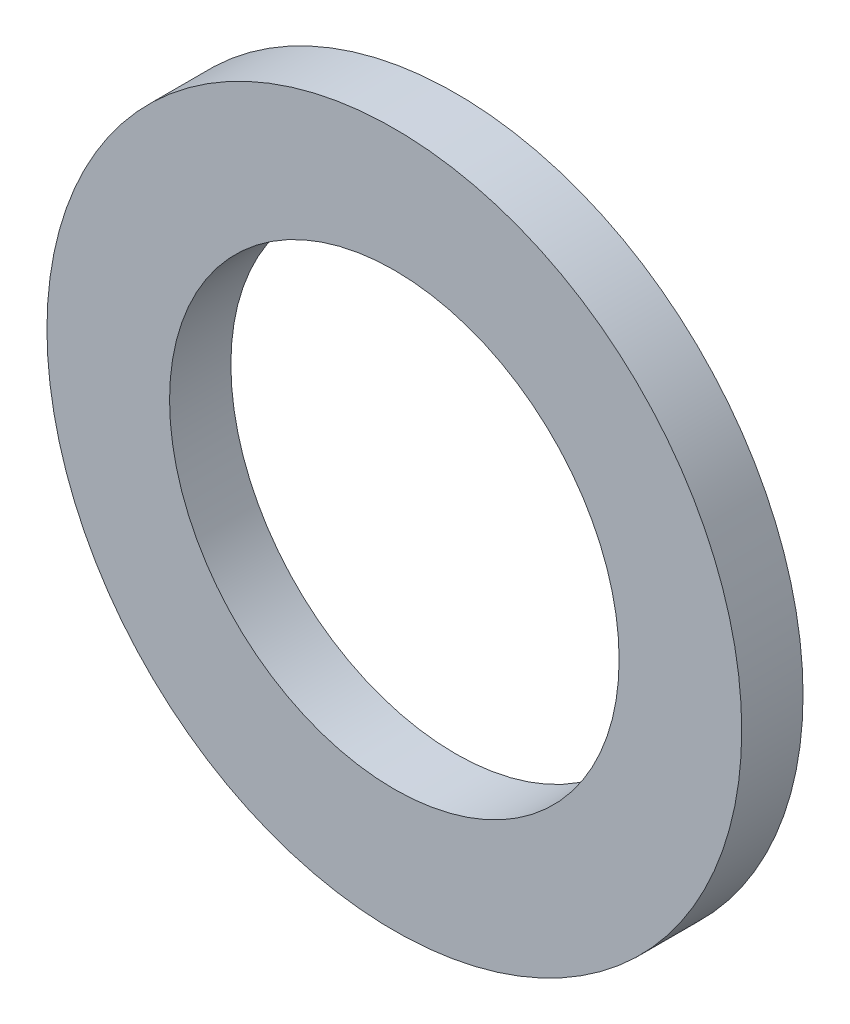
ISO-10303-21;
HEADER;
FILE_DESCRIPTION(('STEP AP214'),'2;1');
FILE_NAME('part.step','',(''),(''),'','','');
FILE_SCHEMA(('AUTOMOTIVE_DESIGN { 1 0 10303 214 1 1 1 1 }'));
ENDSEC;
DATA;
#1=APPLICATION_CONTEXT('core data for automotive mechanical design processes');
#2=APPLICATION_PROTOCOL_DEFINITION('international standard','automotive_design',2000,#1);
#3=PRODUCT_CONTEXT('',#1,'mechanical');
#4=PRODUCT('Part','Part','',(#3));
#5=PRODUCT_RELATED_PRODUCT_CATEGORY('part','',(#4));
#6=PRODUCT_DEFINITION_FORMATION('','',#4);
#7=PRODUCT_DEFINITION_CONTEXT('part definition',#1,'design');
#8=PRODUCT_DEFINITION('design','',#6,#7);
#9=PRODUCT_DEFINITION_SHAPE('','',#8);
#10=(LENGTH_UNIT() NAMED_UNIT(*) SI_UNIT(.MILLI.,.METRE.));
#11=(NAMED_UNIT(*) PLANE_ANGLE_UNIT() SI_UNIT($,.RADIAN.));
#12=(NAMED_UNIT(*) SI_UNIT($,.STERADIAN.) SOLID_ANGLE_UNIT());
#13=UNCERTAINTY_MEASURE_WITH_UNIT(LENGTH_MEASURE(1.E-05),#10,'distance_accuracy_value','');
#14=(GEOMETRIC_REPRESENTATION_CONTEXT(3) GLOBAL_UNCERTAINTY_ASSIGNED_CONTEXT((#13)) GLOBAL_UNIT_ASSIGNED_CONTEXT((#10,
#11,#12)) REPRESENTATION_CONTEXT('',''));
#15=CARTESIAN_POINT('',(0.,0.,0.));
#16=DIRECTION('',(0.,0.,1.));
#17=DIRECTION('',(1.,0.,0.));
#18=AXIS2_PLACEMENT_3D('',#15,#16,#17);
#19=CARTESIAN_POINT('',(0.,0.,3.));
#20=DIRECTION('',(0.,0.,1.));
#21=DIRECTION('',(1.,0.,0.));
#22=AXIS2_PLACEMENT_3D('',#19,#20,#21);
#23=PLANE('',#22);
#24=CARTESIAN_POINT('',(0.,0.,3.));
#25=DIRECTION('',(0.,0.,1.));
#26=DIRECTION('',(1.,0.,0.));
#27=AXIS2_PLACEMENT_3D('',#24,#25,#26);
#28=CIRCLE('',#27,17.);
#29=CARTESIAN_POINT('',(17.,0.,3.));
#30=VERTEX_POINT('',#29);
#31=EDGE_CURVE('E10',#30,#30,#28,.T.);
#32=ORIENTED_EDGE('',*,*,#31,.T.);
#33=EDGE_LOOP('',(#32));
#34=FACE_BOUND('',#33,.T.);
#35=CARTESIAN_POINT('',(0.,0.,3.));
#36=DIRECTION('',(0.,0.,1.));
#37=DIRECTION('',(1.,0.,0.));
#38=AXIS2_PLACEMENT_3D('',#35,#36,#37);
#39=CIRCLE('',#38,11.);
#40=CARTESIAN_POINT('',(11.,0.,3.));
#41=VERTEX_POINT('',#40);
#42=EDGE_CURVE('E39',#41,#41,#39,.T.);
#43=ORIENTED_EDGE('',*,*,#42,.F.);
#44=EDGE_LOOP('',(#43));
#45=FACE_BOUND('',#44,.T.);
#46=ADVANCED_FACE('F28',(#34,#45),#23,.T.);
#47=CARTESIAN_POINT('',(0.,0.,0.));
#48=DIRECTION('',(0.,0.,1.));
#49=DIRECTION('',(1.,0.,0.));
#50=AXIS2_PLACEMENT_3D('',#47,#48,#49);
#51=PLANE('',#50);
#52=CARTESIAN_POINT('',(0.,0.,0.));
#53=DIRECTION('',(0.,0.,1.));
#54=DIRECTION('',(1.,0.,0.));
#55=AXIS2_PLACEMENT_3D('',#52,#53,#54);
#56=CIRCLE('',#55,17.);
#57=CARTESIAN_POINT('',(17.,0.,0.));
#58=VERTEX_POINT('',#57);
#59=EDGE_CURVE('E35',#58,#58,#56,.T.);
#60=ORIENTED_EDGE('',*,*,#59,.F.);
#61=EDGE_LOOP('',(#60));
#62=FACE_BOUND('',#61,.T.);
#63=CARTESIAN_POINT('',(0.,0.,0.));
#64=DIRECTION('',(0.,0.,1.));
#65=DIRECTION('',(1.,0.,0.));
#66=AXIS2_PLACEMENT_3D('',#63,#64,#65);
#67=CIRCLE('',#66,11.);
#68=CARTESIAN_POINT('',(11.,0.,0.));
#69=VERTEX_POINT('',#68);
#70=EDGE_CURVE('E43',#69,#69,#67,.T.);
#71=ORIENTED_EDGE('',*,*,#70,.T.);
#72=EDGE_LOOP('',(#71));
#73=FACE_BOUND('',#72,.T.);
#74=ADVANCED_FACE('F49',(#62,#73),#51,.F.);
#75=CARTESIAN_POINT('',(0.,0.,3.));
#76=DIRECTION('',(0.,0.,-1.));
#77=DIRECTION('',(-1.,0.,0.));
#78=AXIS2_PLACEMENT_3D('',#75,#76,#77);
#79=CYLINDRICAL_SURFACE('',#78,17.);
#80=ORIENTED_EDGE('',*,*,#31,.F.);
#81=EDGE_LOOP('',(#80));
#82=FACE_BOUND('',#81,.T.);
#83=ORIENTED_EDGE('',*,*,#59,.T.);
#84=EDGE_LOOP('',(#83));
#85=FACE_BOUND('',#84,.T.);
#86=ADVANCED_FACE('F30',(#82,#85),#79,.T.);
#87=CARTESIAN_POINT('',(0.,0.,3.));
#88=DIRECTION('',(0.,0.,-1.));
#89=DIRECTION('',(-1.,0.,0.));
#90=AXIS2_PLACEMENT_3D('',#87,#88,#89);
#91=CYLINDRICAL_SURFACE('',#90,11.);
#92=ORIENTED_EDGE('',*,*,#42,.T.);
#93=EDGE_LOOP('',(#92));
#94=FACE_BOUND('',#93,.T.);
#95=ORIENTED_EDGE('',*,*,#70,.F.);
#96=EDGE_LOOP('',(#95));
#97=FACE_BOUND('',#96,.T.);
#98=ADVANCED_FACE('F51',(#94,#97),#91,.F.);
#99=CLOSED_SHELL('',(#46,#74,#86,#98));
#100=MANIFOLD_SOLID_BREP('B2',#99);
#101=ADVANCED_BREP_SHAPE_REPRESENTATION('',(#18,#100),#14);
#102=SHAPE_DEFINITION_REPRESENTATION(#9,#101);
ENDSEC;
END-ISO-10303-21;
